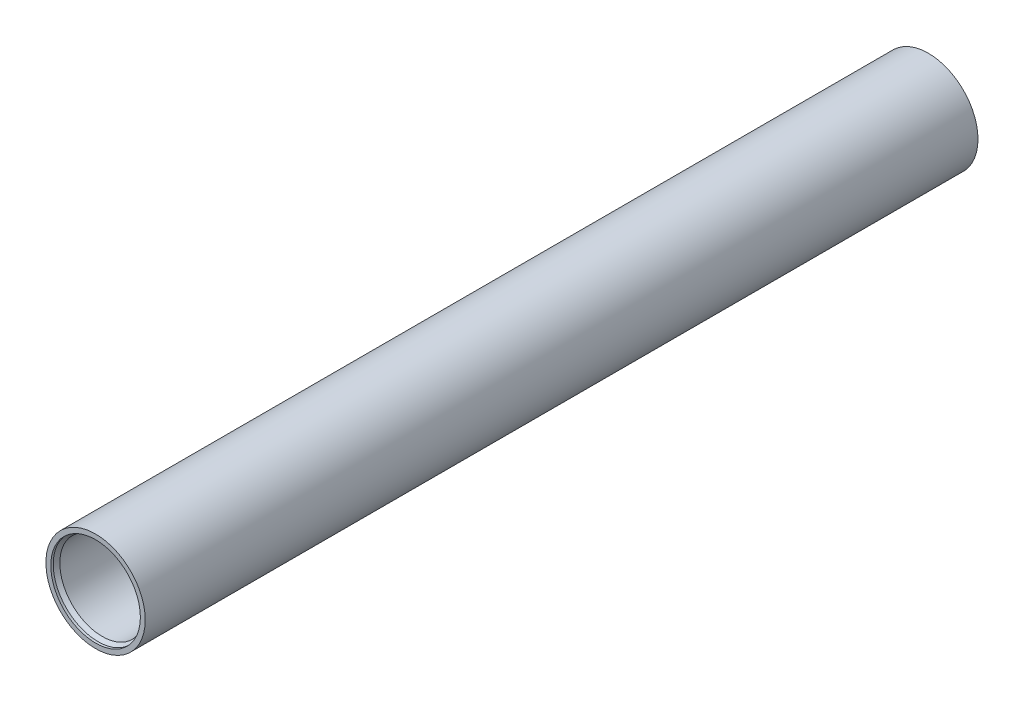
from build123d import *


with BuildPart() as part:
    # Sketch2 → Revolve1 (revolve)
    with BuildSketch(Plane(origin=(0, 0, 0), x_dir=(0, 0, -1), z_dir=(1, 0, 0)), mode=Mode.PRIVATE) as revolve1_sk:
        Polygon((-173.0375, 20.6375), (-173.0375, 18.6182), (-172.0215, 18.6182), (-170.283733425, 17.6149), (-142.875, 17.6149), (-142.875, 17.6276), (-125.4125, 17.6276), (-125.4125, 17.4625), (-93.5355, 17.4625), (-93.5355, 16.2306), (4.6482, 16.2306), (4.6482, 17.4625), (19.05, 17.4625), (19.05, 17.6276), (106.3625, 17.6276), (106.3625, 17.6149), (170.283733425, 17.6149), (172.0215, 18.6182), (173.0375, 18.6182), (173.0375, 20.6375), align=None)
    revolve(revolve1_sk.sketch.rotate(Axis((0, 0, 260.460594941), (0, 0, -1)), 90), axis=Axis((0, 0, 260.460594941), (0, 0, -1)))


solid = part.part
